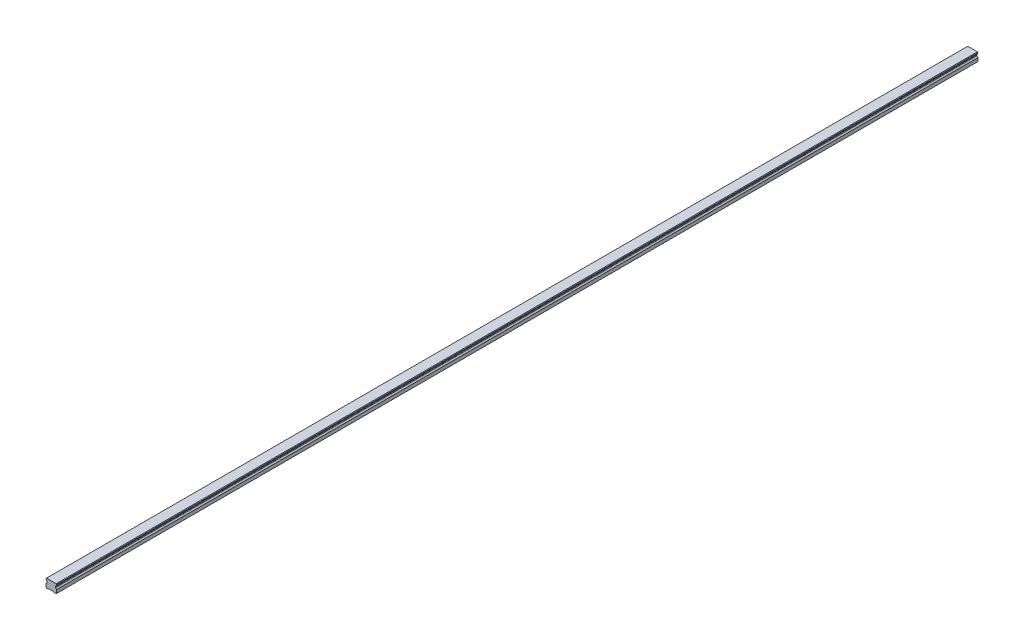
from build123d import *

# Parameters (mm, degrees)
SKETCH1_W           = 20
SKETCH1_H           = 16.3
BOSS_EXTRUDE1_DEPTH = 860
CUT_EXTRUDE1_DEPTH  = 1721.106301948
CHAMFER1_SIZE       = 1
FILLET1_R           = 1
CUT_EXTRUDE2_DEPTH  = 1721.106301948
SKETCH5_R           = 3
SKETCH5_R_2         = 2.5
CUT_EXTRUDE5_DEPTH  = 10
SKETCH5_2_R         = 2.5
CUT_EXTRUDE6_DEPTH  = 13
LPATTERN2_COUNT     = 29
LPATTERN2_PITCH     = 60


with BuildPart() as part:
    # Sketch1 → Boss-Extrude1 (new, symmetric)
    with BuildSketch(Plane.XY):
        with Locations((0, 8.15)):
            Rectangle(SKETCH1_W, SKETCH1_H)
    extrude(amount=BOSS_EXTRUDE1_DEPTH, both=True)

    # Sketch2 → Cut-Extrude1 (cut, through all)
    with BuildSketch(Plane.XY.offset(860)):
        Polygon((-10, 14.3), (-10, 7.3), (-7.666666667, 9.633333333), (-7.666666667, 11.966666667), align=None)
        Polygon((7.666666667, 11.966666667), (10, 14.3), (10, 7.3), (7.666666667, 9.633333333), align=None)
    extrude(amount=-CUT_EXTRUDE1_DEPTH, mode=Mode.SUBTRACT)

    # Chamfer1
    chamfer1_edges = [part.edges().sort_by_distance(p)[0] for p in [
        (-10, 16.3, 0),
        (10, 16.3, 0),
        (10, 0, 0),
        (-10, 0, 0),
    ]]
    chamfer(chamfer1_edges, length=CHAMFER1_SIZE)

    # Fillet1
    fillet1_edges = [part.edges().sort_by_distance(p)[0] for p in [
        (-7.666666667, 11.966666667, 0),
        (-7.666666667, 9.633333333, 0),
        (7.666666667, 9.633333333, 0),
        (7.666666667, 11.966666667, 0),
    ]]
    fillet(fillet1_edges, radius=FILLET1_R)

    # Sketch3 → Cut-Extrude2 (cut, through all)
    with BuildSketch(Plane.XY.offset(860)):
        Polygon((-6, 0), (-5, 1), (5, 1), (6, 0), align=None)
    extrude(amount=-CUT_EXTRUDE2_DEPTH, mode=Mode.SUBTRACT)

    # Sketch5 → Cut-Extrude5 (cut)
    with BuildSketch(Plane.XZ.offset(-1)):
        with Locations(Location((0, 840, 0), (0, 0, 270))):
            Circle(SKETCH5_R)
        with Locations(Location((0, 840, 0), (0, 0, 270))):
            Circle(SKETCH5_R_2, mode=Mode.SUBTRACT)
    cut_extrude5 = extrude(amount=-CUT_EXTRUDE5_DEPTH, mode=Mode.SUBTRACT)

    # Sketch5_2 → Cut-Extrude6 (cut)
    with BuildSketch(Plane.XZ.offset(-1)):
        with Locations(Location((0, 840, 0), (0, 0, 270))):
            Circle(SKETCH5_2_R)
    cut_extrude6 = extrude(amount=-CUT_EXTRUDE6_DEPTH, mode=Mode.SUBTRACT)

    # Cut-Extrude7 cone 1 section (on through the dimple's axis) → Cut-Extrude7 (revolve, cut)
    with BuildSketch(Plane(origin=(0, 14, 840), x_dir=(0, 0, -1), z_dir=(1, 0, 0))):
        Polygon((0, 0), (2.5, 0), (0, 1.443375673), align=None)
    cut_extrude7 = revolve(axis=Axis((0, 14, 840), (0, 1, 0)), mode=Mode.SUBTRACT)

    # LPattern2: Cut-Extrude5, Cut-Extrude6, Cut-Extrude7 ×29
    with Locations(*[(0, 0, -i * LPATTERN2_PITCH) for i in range(1, LPATTERN2_COUNT)]):
        add(cut_extrude5, mode=Mode.SUBTRACT)
        add(cut_extrude6, mode=Mode.SUBTRACT)
        add(cut_extrude7, mode=Mode.SUBTRACT)


solid = part.part
